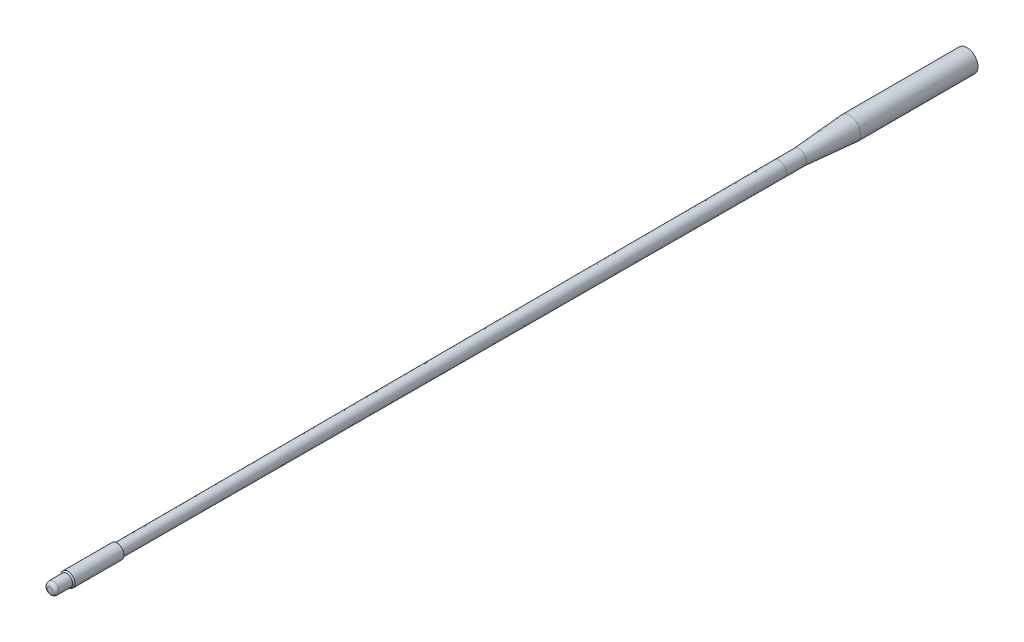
ISO-10303-21;
HEADER;
FILE_DESCRIPTION(('STEP AP214'),'2;1');
FILE_NAME('part.step','',(''),(''),'','','');
FILE_SCHEMA(('AUTOMOTIVE_DESIGN { 1 0 10303 214 1 1 1 1 }'));
ENDSEC;
DATA;
#1=APPLICATION_CONTEXT('core data for automotive mechanical design processes');
#2=APPLICATION_PROTOCOL_DEFINITION('international standard','automotive_design',2000,#1);
#3=PRODUCT_CONTEXT('',#1,'mechanical');
#4=PRODUCT('Part','Part','',(#3));
#5=PRODUCT_RELATED_PRODUCT_CATEGORY('part','',(#4));
#6=PRODUCT_DEFINITION_FORMATION('','',#4);
#7=PRODUCT_DEFINITION_CONTEXT('part definition',#1,'design');
#8=PRODUCT_DEFINITION('design','',#6,#7);
#9=PRODUCT_DEFINITION_SHAPE('','',#8);
#10=(LENGTH_UNIT() NAMED_UNIT(*) SI_UNIT(.MILLI.,.METRE.));
#11=(NAMED_UNIT(*) PLANE_ANGLE_UNIT() SI_UNIT($,.RADIAN.));
#12=(NAMED_UNIT(*) SI_UNIT($,.STERADIAN.) SOLID_ANGLE_UNIT());
#13=UNCERTAINTY_MEASURE_WITH_UNIT(LENGTH_MEASURE(1.E-05),#10,'distance_accuracy_value','');
#14=(GEOMETRIC_REPRESENTATION_CONTEXT(3) GLOBAL_UNCERTAINTY_ASSIGNED_CONTEXT((#13)) GLOBAL_UNIT_ASSIGNED_CONTEXT((#10,
#11,#12)) REPRESENTATION_CONTEXT('',''));
#15=CARTESIAN_POINT('',(0.,0.,0.));
#16=DIRECTION('',(0.,0.,1.));
#17=DIRECTION('',(1.,0.,0.));
#18=AXIS2_PLACEMENT_3D('',#15,#16,#17);
#19=CARTESIAN_POINT('',(0.,0.,127.));
#20=DIRECTION('',(0.,0.,-1.));
#21=DIRECTION('',(-1.,0.,0.));
#22=AXIS2_PLACEMENT_3D('',#19,#20,#21);
#23=CYLINDRICAL_SURFACE('',#22,8.3566);
#24=CARTESIAN_POINT('',(0.,0.,88.9));
#25=DIRECTION('',(0.,0.,1.));
#26=DIRECTION('',(1.,0.,0.));
#27=AXIS2_PLACEMENT_3D('',#24,#25,#26);
#28=CIRCLE('',#27,8.3566);
#29=CARTESIAN_POINT('',(8.3566,0.,88.9));
#30=VERTEX_POINT('',#29);
#31=EDGE_CURVE('E58',#30,#30,#28,.F.);
#32=ORIENTED_EDGE('',*,*,#31,.T.);
#33=EDGE_LOOP('',(#32));
#34=FACE_BOUND('',#33,.T.);
#35=CARTESIAN_POINT('',(0.,0.,0.));
#36=DIRECTION('',(0.,0.,1.));
#37=DIRECTION('',(1.,0.,0.));
#38=AXIS2_PLACEMENT_3D('',#35,#36,#37);
#39=CIRCLE('',#38,8.3566);
#40=CARTESIAN_POINT('',(8.3566,0.,0.));
#41=VERTEX_POINT('',#40);
#42=EDGE_CURVE('E64',#41,#41,#39,.T.);
#43=ORIENTED_EDGE('',*,*,#42,.T.);
#44=EDGE_LOOP('',(#43));
#45=FACE_BOUND('',#44,.T.);
#46=ADVANCED_FACE('F33',(#34,#45),#23,.T.);
#47=CARTESIAN_POINT('',(0.,0.,0.));
#48=DIRECTION('',(0.,0.,1.));
#49=DIRECTION('',(1.,0.,0.));
#50=AXIS2_PLACEMENT_3D('',#47,#48,#49);
#51=PLANE('',#50);
#52=ORIENTED_EDGE('',*,*,#42,.F.);
#53=EDGE_LOOP('',(#52));
#54=FACE_BOUND('',#53,.T.);
#55=ADVANCED_FACE('F89',(#54),#51,.F.);
#56=CARTESIAN_POINT('',(0.,0.,127.));
#57=DIRECTION('',(0.,0.,-1.));
#58=DIRECTION('',(-1.,0.,0.));
#59=AXIS2_PLACEMENT_3D('',#56,#57,#58);
#60=CONICAL_SURFACE('',#59,5.4864,0.0751913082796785);
#61=ORIENTED_EDGE('',*,*,#31,.F.);
#62=EDGE_LOOP('',(#61));
#63=FACE_BOUND('',#62,.T.);
#64=CARTESIAN_POINT('',(0.,0.,127.));
#65=DIRECTION('',(0.,0.,1.));
#66=DIRECTION('',(1.,0.,0.));
#67=AXIS2_PLACEMENT_3D('',#64,#65,#66);
#68=CIRCLE('',#67,5.4864);
#69=CARTESIAN_POINT('',(5.4864,0.,127.));
#70=VERTEX_POINT('',#69);
#71=EDGE_CURVE('E61',#70,#70,#68,.T.);
#72=ORIENTED_EDGE('',*,*,#71,.F.);
#73=EDGE_LOOP('',(#72));
#74=FACE_BOUND('',#73,.T.);
#75=ADVANCED_FACE('F94',(#63,#74),#60,.T.);
#76=CARTESIAN_POINT('',(0.,0.,643.89));
#77=DIRECTION('',(0.,0.,-1.));
#78=DIRECTION('',(-1.,0.,0.));
#79=AXIS2_PLACEMENT_3D('',#76,#77,#78);
#80=CYLINDRICAL_SURFACE('',#79,5.4864);
#81=CARTESIAN_POINT('',(0.,0.,142.24));
#82=DIRECTION('',(0.,0.,1.));
#83=DIRECTION('',(1.,0.,0.));
#84=AXIS2_PLACEMENT_3D('',#81,#82,#83);
#85=CIRCLE('',#84,5.4864);
#86=CARTESIAN_POINT('',(5.4864,0.,142.24));
#87=VERTEX_POINT('',#86);
#88=EDGE_CURVE('E52',#87,#87,#85,.F.);
#89=ORIENTED_EDGE('',*,*,#88,.T.);
#90=EDGE_LOOP('',(#89));
#91=FACE_BOUND('',#90,.T.);
#92=ORIENTED_EDGE('',*,*,#71,.T.);
#93=EDGE_LOOP('',(#92));
#94=FACE_BOUND('',#93,.T.);
#95=ADVANCED_FACE('F102',(#91,#94),#80,.T.);
#96=CARTESIAN_POINT('',(0.,0.,643.89));
#97=DIRECTION('',(0.,0.,-1.));
#98=DIRECTION('',(-1.,0.,0.));
#99=AXIS2_PLACEMENT_3D('',#96,#97,#98);
#100=CONICAL_SURFACE('',#99,4.4704,0.00202531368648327);
#101=ORIENTED_EDGE('',*,*,#88,.F.);
#102=EDGE_LOOP('',(#101));
#103=FACE_BOUND('',#102,.T.);
#104=CARTESIAN_POINT('',(0.,0.,643.89));
#105=DIRECTION('',(0.,0.,1.));
#106=DIRECTION('',(1.,0.,0.));
#107=AXIS2_PLACEMENT_3D('',#104,#105,#106);
#108=CIRCLE('',#107,4.4704);
#109=CARTESIAN_POINT('',(4.4704,0.,643.89));
#110=VERTEX_POINT('',#109);
#111=EDGE_CURVE('E55',#110,#110,#108,.T.);
#112=ORIENTED_EDGE('',*,*,#111,.F.);
#113=EDGE_LOOP('',(#112));
#114=FACE_BOUND('',#113,.T.);
#115=ADVANCED_FACE('F85',(#103,#114),#100,.T.);
#116=CARTESIAN_POINT('',(0.,0.,681.99));
#117=DIRECTION('',(0.,0.,-1.));
#118=DIRECTION('',(-1.,0.,0.));
#119=AXIS2_PLACEMENT_3D('',#116,#117,#118);
#120=CYLINDRICAL_SURFACE('',#119,5.3721);
#121=CARTESIAN_POINT('',(0.,0.,681.0629));
#122=DIRECTION('',(0.,0.,1.));
#123=DIRECTION('',(1.,0.,0.));
#124=AXIS2_PLACEMENT_3D('',#121,#122,#123);
#125=CIRCLE('',#124,5.3721);
#126=CARTESIAN_POINT('',(-5.3721,0.,681.0629));
#127=VERTEX_POINT('',#126);
#128=EDGE_CURVE('E43',#127,#127,#125,.F.);
#129=CARTESIAN_POINT('',(0.,0.,643.89));
#130=DIRECTION('',(0.,0.,1.));
#131=DIRECTION('',(1.,0.,0.));
#132=AXIS2_PLACEMENT_3D('',#129,#130,#131);
#133=CIRCLE('',#132,5.3721);
#134=CARTESIAN_POINT('',(-5.3721,0.,643.89));
#135=VERTEX_POINT('',#134);
#136=EDGE_CURVE('E67',#135,#135,#133,.T.);
#137=CARTESIAN_POINT('',(-5.3721,0.,681.0629));
#138=CARTESIAN_POINT('',(-5.3721,0.,680.675682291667));
#139=CARTESIAN_POINT('',(-5.3721,0.,680.288464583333));
#140=CARTESIAN_POINT('',(-5.3721,0.,679.514029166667));
#141=CARTESIAN_POINT('',(-5.3721,0.,679.126811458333));
#142=CARTESIAN_POINT('',(-5.3721,0.,678.352376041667));
#143=CARTESIAN_POINT('',(-5.3721,0.,677.965158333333));
#144=CARTESIAN_POINT('',(-5.3721,0.,677.190722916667));
#145=CARTESIAN_POINT('',(-5.3721,0.,676.803505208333));
#146=CARTESIAN_POINT('',(-5.3721,0.,676.029069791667));
#147=CARTESIAN_POINT('',(-5.3721,0.,675.641852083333));
#148=CARTESIAN_POINT('',(-5.3721,0.,674.867416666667));
#149=CARTESIAN_POINT('',(-5.3721,0.,674.480198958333));
#150=CARTESIAN_POINT('',(-5.3721,0.,673.705763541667));
#151=CARTESIAN_POINT('',(-5.3721,0.,673.318545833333));
#152=CARTESIAN_POINT('',(-5.3721,0.,672.544110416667));
#153=CARTESIAN_POINT('',(-5.3721,0.,672.156892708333));
#154=CARTESIAN_POINT('',(-5.3721,0.,671.382457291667));
#155=CARTESIAN_POINT('',(-5.3721,0.,670.995239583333));
#156=CARTESIAN_POINT('',(-5.3721,0.,670.220804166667));
#157=CARTESIAN_POINT('',(-5.3721,0.,669.833586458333));
#158=CARTESIAN_POINT('',(-5.3721,0.,669.059151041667));
#159=CARTESIAN_POINT('',(-5.3721,0.,668.671933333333));
#160=CARTESIAN_POINT('',(-5.3721,0.,667.897497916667));
#161=CARTESIAN_POINT('',(-5.3721,0.,667.510280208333));
#162=CARTESIAN_POINT('',(-5.3721,0.,666.735844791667));
#163=CARTESIAN_POINT('',(-5.3721,0.,666.348627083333));
#164=CARTESIAN_POINT('',(-5.3721,0.,665.574191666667));
#165=CARTESIAN_POINT('',(-5.3721,0.,665.186973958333));
#166=CARTESIAN_POINT('',(-5.3721,0.,664.412538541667));
#167=CARTESIAN_POINT('',(-5.3721,0.,664.025320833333));
#168=CARTESIAN_POINT('',(-5.3721,0.,663.250885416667));
#169=CARTESIAN_POINT('',(-5.3721,0.,662.863667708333));
#170=CARTESIAN_POINT('',(-5.3721,0.,662.089232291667));
#171=CARTESIAN_POINT('',(-5.3721,0.,661.702014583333));
#172=CARTESIAN_POINT('',(-5.3721,0.,660.927579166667));
#173=CARTESIAN_POINT('',(-5.3721,0.,660.540361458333));
#174=CARTESIAN_POINT('',(-5.3721,0.,659.765926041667));
#175=CARTESIAN_POINT('',(-5.3721,0.,659.378708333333));
#176=CARTESIAN_POINT('',(-5.3721,0.,658.604272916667));
#177=CARTESIAN_POINT('',(-5.3721,0.,658.217055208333));
#178=CARTESIAN_POINT('',(-5.3721,0.,657.442619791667));
#179=CARTESIAN_POINT('',(-5.3721,0.,657.055402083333));
#180=CARTESIAN_POINT('',(-5.3721,0.,656.280966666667));
#181=CARTESIAN_POINT('',(-5.3721,0.,655.893748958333));
#182=CARTESIAN_POINT('',(-5.3721,0.,655.119313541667));
#183=CARTESIAN_POINT('',(-5.3721,0.,654.732095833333));
#184=CARTESIAN_POINT('',(-5.3721,0.,653.957660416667));
#185=CARTESIAN_POINT('',(-5.3721,0.,653.570442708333));
#186=CARTESIAN_POINT('',(-5.3721,0.,652.796007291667));
#187=CARTESIAN_POINT('',(-5.3721,0.,652.408789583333));
#188=CARTESIAN_POINT('',(-5.3721,0.,651.634354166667));
#189=CARTESIAN_POINT('',(-5.3721,0.,651.247136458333));
#190=CARTESIAN_POINT('',(-5.3721,0.,650.472701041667));
#191=CARTESIAN_POINT('',(-5.3721,0.,650.085483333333));
#192=CARTESIAN_POINT('',(-5.3721,0.,649.311047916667));
#193=CARTESIAN_POINT('',(-5.3721,0.,648.923830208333));
#194=CARTESIAN_POINT('',(-5.3721,0.,648.149394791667));
#195=CARTESIAN_POINT('',(-5.3721,0.,647.762177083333));
#196=CARTESIAN_POINT('',(-5.3721,0.,646.987741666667));
#197=CARTESIAN_POINT('',(-5.3721,0.,646.600523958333));
#198=CARTESIAN_POINT('',(-5.3721,0.,645.826088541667));
#199=CARTESIAN_POINT('',(-5.3721,0.,645.438870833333));
#200=CARTESIAN_POINT('',(-5.3721,0.,644.664435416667));
#201=CARTESIAN_POINT('',(-5.3721,0.,644.277217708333));
#202=CARTESIAN_POINT('',(-5.3721,0.,643.89));
#203=B_SPLINE_CURVE_WITH_KNOTS('',3,(#137,#138,#139,#140,#141,#142,#143,#144,#145,#146,#147,
#148,#149,#150,#151,#152,#153,#154,#155,#156,#157,#158,#159,#160,#161,#162,#163,#164,#165,#166,
#167,#168,#169,#170,#171,#172,#173,#174,#175,#176,#177,#178,#179,#180,#181,#182,#183,#184,#185,
#186,#187,#188,#189,#190,#191,#192,#193,#194,#195,#196,#197,#198,#199,#200,#201,#202),
.UNSPECIFIED.,.F.,.F.,(4,2,2,2,2,2,2,2,2,2,2,2,2,2,2,2,2,2,2,2,2,2,2,2,2,2,2,2,2,2,2,2,4),(0.,
1.16165312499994,2.32330624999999,3.48495937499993,4.64661249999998,5.80826562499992,
6.96991874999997,8.13157187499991,9.29322499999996,10.454878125,11.61653125,12.778184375,
13.9398374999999,15.101490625,16.2631437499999,17.424796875,18.58645,19.748103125,20.90975625,
22.071409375,23.2330625,24.394715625,25.55636875,26.7180218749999,27.879675,29.041328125,
30.20298125,31.364634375,32.5262875,33.687940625,34.84959375,36.011246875,37.1729000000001),.UNSPECIFIED.);
#204=EDGE_CURVE('BSEAM71',#127,#135,#203,.T.);
#205=ORIENTED_EDGE('',*,*,#128,.T.);
#206=ORIENTED_EDGE('',*,*,#136,.T.);
#207=ORIENTED_EDGE('',*,*,#204,.T.);
#208=ORIENTED_EDGE('',*,*,#204,.F.);
#209=EDGE_LOOP('',(#205,#207,#206,#208));
#210=FACE_BOUND('',#209,.T.);
#211=ADVANCED_FACE('F71',(#210),#120,.T.);
#212=CARTESIAN_POINT('',(0.,0.,643.89));
#213=DIRECTION('',(0.,0.,1.));
#214=DIRECTION('',(1.,0.,0.));
#215=AXIS2_PLACEMENT_3D('',#212,#213,#214);
#216=PLANE('',#215);
#217=ORIENTED_EDGE('',*,*,#111,.T.);
#218=EDGE_LOOP('',(#217));
#219=FACE_BOUND('',#218,.T.);
#220=ORIENTED_EDGE('',*,*,#136,.F.);
#221=EDGE_LOOP('',(#220));
#222=FACE_BOUND('',#221,.T.);
#223=ADVANCED_FACE('F73',(#219,#222),#216,.F.);
#224=CARTESIAN_POINT('',(0.,0.,681.99));
#225=DIRECTION('',(0.,0.,-1.));
#226=DIRECTION('',(-1.,0.,0.));
#227=AXIS2_PLACEMENT_3D('',#224,#225,#226);
#228=CONICAL_SURFACE('',#227,4.445,0.785398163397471);
#229=ORIENTED_EDGE('',*,*,#128,.F.);
#230=EDGE_LOOP('',(#229));
#231=FACE_BOUND('',#230,.T.);
#232=CARTESIAN_POINT('',(0.,0.,681.99));
#233=DIRECTION('',(0.,0.,1.));
#234=DIRECTION('',(1.,0.,0.));
#235=AXIS2_PLACEMENT_3D('',#232,#233,#234);
#236=CIRCLE('',#235,4.445);
#237=CARTESIAN_POINT('',(4.445,0.,681.99));
#238=VERTEX_POINT('',#237);
#239=EDGE_CURVE('E47',#238,#238,#236,.T.);
#240=ORIENTED_EDGE('',*,*,#239,.F.);
#241=EDGE_LOOP('',(#240));
#242=FACE_BOUND('',#241,.T.);
#243=ADVANCED_FACE('F75',(#231,#242),#228,.T.);
#244=CARTESIAN_POINT('',(0.,0.,694.69));
#245=DIRECTION('',(0.,0.,-1.));
#246=DIRECTION('',(-1.,0.,0.));
#247=AXIS2_PLACEMENT_3D('',#244,#245,#246);
#248=CYLINDRICAL_SURFACE('',#247,4.445);
#249=CARTESIAN_POINT('',(0.,0.,692.15));
#250=DIRECTION('',(0.,0.,1.));
#251=DIRECTION('',(1.,0.,0.));
#252=AXIS2_PLACEMENT_3D('',#249,#250,#251);
#253=CIRCLE('',#252,4.445);
#254=CARTESIAN_POINT('',(4.445,0.,692.15));
#255=VERTEX_POINT('',#254);
#256=EDGE_CURVE('E10',#255,#255,#253,.F.);
#257=ORIENTED_EDGE('',*,*,#256,.T.);
#258=EDGE_LOOP('',(#257));
#259=FACE_BOUND('',#258,.T.);
#260=ORIENTED_EDGE('',*,*,#239,.T.);
#261=EDGE_LOOP('',(#260));
#262=FACE_BOUND('',#261,.T.);
#263=ADVANCED_FACE('F82',(#259,#262),#248,.T.);
#264=CARTESIAN_POINT('',(0.,0.,694.69));
#265=DIRECTION('',(0.,0.,1.));
#266=DIRECTION('',(1.,0.,0.));
#267=AXIS2_PLACEMENT_3D('',#264,#265,#266);
#268=PLANE('',#267);
#269=CARTESIAN_POINT('',(0.,0.,694.69));
#270=DIRECTION('',(0.,0.,1.));
#271=DIRECTION('',(1.,0.,0.));
#272=AXIS2_PLACEMENT_3D('',#269,#270,#271);
#273=CIRCLE('',#272,1.905);
#274=CARTESIAN_POINT('',(1.905,0.,694.69));
#275=VERTEX_POINT('',#274);
#276=EDGE_CURVE('E39',#275,#275,#273,.T.);
#277=ORIENTED_EDGE('',*,*,#276,.T.);
#278=EDGE_LOOP('',(#277));
#279=FACE_BOUND('',#278,.T.);
#280=ADVANCED_FACE('F142',(#279),#268,.T.);
#281=CARTESIAN_POINT('',(0.,0.,692.15));
#282=DIRECTION('',(0.,0.,1.));
#283=DIRECTION('',(1.,0.,0.));
#284=AXIS2_PLACEMENT_3D('',#281,#282,#283);
#285=DEGENERATE_TOROIDAL_SURFACE('',#284,1.905,2.54,.T.);
#286=ORIENTED_EDGE('',*,*,#256,.F.);
#287=EDGE_LOOP('',(#286));
#288=FACE_BOUND('',#287,.T.);
#289=ORIENTED_EDGE('',*,*,#276,.F.);
#290=EDGE_LOOP('',(#289));
#291=FACE_BOUND('',#290,.T.);
#292=ADVANCED_FACE('F151',(#288,#291),#285,.T.);
#293=CLOSED_SHELL('',(#46,#55,#75,#95,#115,#211,#223,#243,#263,#280,#292));
#294=MANIFOLD_SOLID_BREP('B2',#293);
#295=ADVANCED_BREP_SHAPE_REPRESENTATION('',(#18,#294),#14);
#296=SHAPE_DEFINITION_REPRESENTATION(#9,#295);
ENDSEC;
END-ISO-10303-21;
